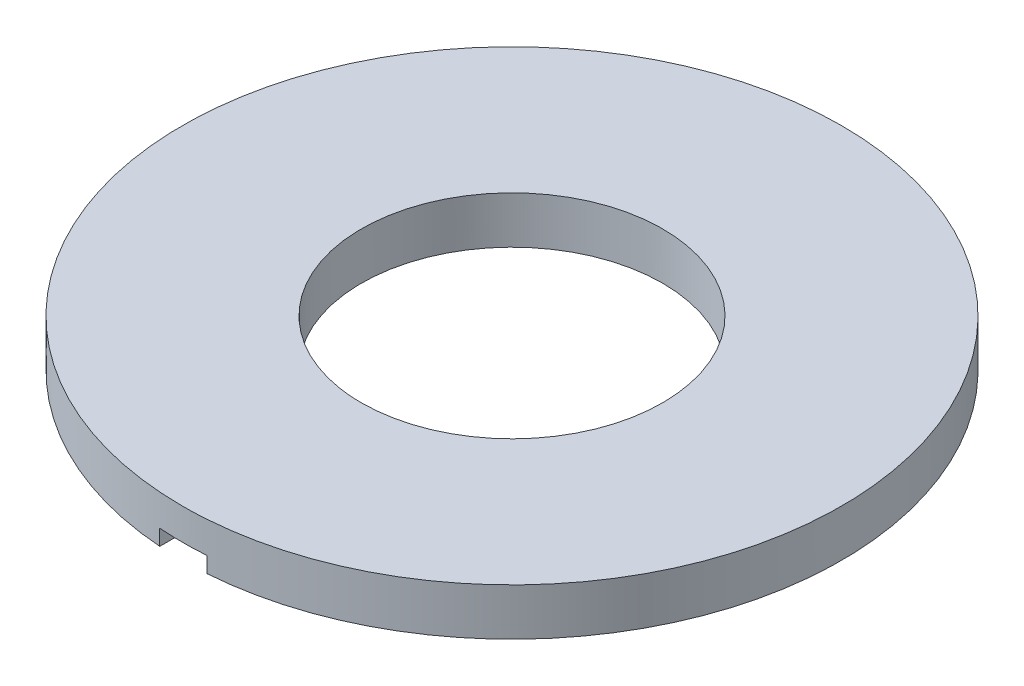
ISO-10303-21;
HEADER;
FILE_DESCRIPTION(('STEP AP214'),'2;1');
FILE_NAME('part.step','',(''),(''),'','','');
FILE_SCHEMA(('AUTOMOTIVE_DESIGN { 1 0 10303 214 1 1 1 1 }'));
ENDSEC;
DATA;
#1=APPLICATION_CONTEXT('core data for automotive mechanical design processes');
#2=APPLICATION_PROTOCOL_DEFINITION('international standard','automotive_design',2000,#1);
#3=PRODUCT_CONTEXT('',#1,'mechanical');
#4=PRODUCT('Part','Part','',(#3));
#5=PRODUCT_RELATED_PRODUCT_CATEGORY('part','',(#4));
#6=PRODUCT_DEFINITION_FORMATION('','',#4);
#7=PRODUCT_DEFINITION_CONTEXT('part definition',#1,'design');
#8=PRODUCT_DEFINITION('design','',#6,#7);
#9=PRODUCT_DEFINITION_SHAPE('','',#8);
#10=(LENGTH_UNIT() NAMED_UNIT(*) SI_UNIT(.MILLI.,.METRE.));
#11=(NAMED_UNIT(*) PLANE_ANGLE_UNIT() SI_UNIT($,.RADIAN.));
#12=(NAMED_UNIT(*) SI_UNIT($,.STERADIAN.) SOLID_ANGLE_UNIT());
#13=UNCERTAINTY_MEASURE_WITH_UNIT(LENGTH_MEASURE(1.E-05),#10,'distance_accuracy_value','');
#14=(GEOMETRIC_REPRESENTATION_CONTEXT(3) GLOBAL_UNCERTAINTY_ASSIGNED_CONTEXT((#13)) GLOBAL_UNIT_ASSIGNED_CONTEXT((#10,
#11,#12)) REPRESENTATION_CONTEXT('',''));
#15=CARTESIAN_POINT('',(0.,0.,0.));
#16=DIRECTION('',(0.,0.,1.));
#17=DIRECTION('',(1.,0.,0.));
#18=AXIS2_PLACEMENT_3D('',#15,#16,#17);
#19=CARTESIAN_POINT('',(0.,0.5,0.));
#20=DIRECTION('',(0.,1.,0.));
#21=DIRECTION('',(0.,0.,1.));
#22=AXIS2_PLACEMENT_3D('',#19,#20,#21);
#23=PLANE('',#22);
#24=CARTESIAN_POINT('',(0.,0.5,0.));
#25=DIRECTION('',(0.,1.,0.));
#26=DIRECTION('',(0.,0.,1.));
#27=AXIS2_PLACEMENT_3D('',#24,#25,#26);
#28=CIRCLE('',#27,3.5);
#29=CARTESIAN_POINT('',(0.,0.5,3.5));
#30=VERTEX_POINT('',#29);
#31=EDGE_CURVE('E113',#30,#30,#28,.T.);
#32=ORIENTED_EDGE('',*,*,#31,.T.);
#33=EDGE_LOOP('',(#32));
#34=FACE_BOUND('',#33,.T.);
#35=CARTESIAN_POINT('',(0.,0.5,0.));
#36=DIRECTION('',(0.,1.,0.));
#37=DIRECTION('',(0.,0.,1.));
#38=AXIS2_PLACEMENT_3D('',#35,#36,#37);
#39=CIRCLE('',#38,1.6);
#40=CARTESIAN_POINT('',(0.,0.5,1.6));
#41=VERTEX_POINT('',#40);
#42=EDGE_CURVE('E102',#41,#41,#39,.T.);
#43=ORIENTED_EDGE('',*,*,#42,.F.);
#44=EDGE_LOOP('',(#43));
#45=FACE_BOUND('',#44,.T.);
#46=ADVANCED_FACE('F39',(#34,#45),#23,.T.);
#47=CARTESIAN_POINT('',(0.,0.,0.));
#48=DIRECTION('',(0.,1.,0.));
#49=DIRECTION('',(0.,0.,1.));
#50=AXIS2_PLACEMENT_3D('',#47,#48,#49);
#51=PLANE('',#50);
#52=CARTESIAN_POINT('',(0.,0.,0.));
#53=DIRECTION('',(0.,1.,0.));
#54=DIRECTION('',(0.,0.,1.));
#55=AXIS2_PLACEMENT_3D('',#52,#53,#54);
#56=CIRCLE('',#55,3.5);
#57=CARTESIAN_POINT('',(0.25,0.,3.49106001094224));
#58=VERTEX_POINT('',#57);
#59=CARTESIAN_POINT('',(-0.25,0.,3.49106001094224));
#60=VERTEX_POINT('',#59);
#61=EDGE_CURVE('E94',#58,#60,#56,.T.);
#62=ORIENTED_EDGE('',*,*,#61,.F.);
#63=DIRECTION('',(0.,0.,1.));
#64=VECTOR('',#63,1.);
#65=CARTESIAN_POINT('',(0.25,0.,-0.3));
#66=LINE('',#65,#64);
#67=CARTESIAN_POINT('',(0.25,0.,1.58034806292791));
#68=VERTEX_POINT('',#67);
#69=EDGE_CURVE('E81',#68,#58,#66,.T.);
#70=ORIENTED_EDGE('',*,*,#69,.F.);
#71=CARTESIAN_POINT('',(0.,0.,0.));
#72=DIRECTION('',(0.,1.,0.));
#73=DIRECTION('',(0.,0.,1.));
#74=AXIS2_PLACEMENT_3D('',#71,#72,#73);
#75=CIRCLE('',#74,1.6);
#76=CARTESIAN_POINT('',(-0.25,0.,1.58034806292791));
#77=VERTEX_POINT('',#76);
#78=EDGE_CURVE('E92',#68,#77,#75,.T.);
#79=ORIENTED_EDGE('',*,*,#78,.T.);
#80=DIRECTION('',(0.,0.,-1.));
#81=VECTOR('',#80,1.);
#82=CARTESIAN_POINT('',(-0.25,0.,-0.3));
#83=LINE('',#82,#81);
#84=EDGE_CURVE('E96',#60,#77,#83,.T.);
#85=ORIENTED_EDGE('',*,*,#84,.F.);
#86=EDGE_LOOP('',(#62,#70,#79,#85));
#87=FACE_BOUND('',#86,.T.);
#88=ADVANCED_FACE('F90',(#87),#51,.F.);
#89=CARTESIAN_POINT('',(0.,0.5,0.));
#90=DIRECTION('',(0.,-1.,0.));
#91=DIRECTION('',(0.,0.,-1.));
#92=AXIS2_PLACEMENT_3D('',#89,#90,#91);
#93=CYLINDRICAL_SURFACE('',#92,3.5);
#94=ORIENTED_EDGE('',*,*,#31,.F.);
#95=EDGE_LOOP('',(#94));
#96=FACE_BOUND('',#95,.T.);
#97=CARTESIAN_POINT('',(0.,0.166666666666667,0.));
#98=DIRECTION('',(0.,1.,0.));
#99=DIRECTION('',(0.,0.,1.));
#100=AXIS2_PLACEMENT_3D('',#97,#98,#99);
#101=CIRCLE('',#100,3.5);
#102=CARTESIAN_POINT('',(-0.25,0.166666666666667,3.49106001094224));
#103=VERTEX_POINT('',#102);
#104=CARTESIAN_POINT('',(0.25,0.166666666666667,3.49106001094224));
#105=VERTEX_POINT('',#104);
#106=EDGE_CURVE('E60',#103,#105,#101,.T.);
#107=ORIENTED_EDGE('',*,*,#106,.T.);
#108=DIRECTION('',(0.,-1.,0.));
#109=VECTOR('',#108,1.);
#110=CARTESIAN_POINT('',(0.25,0.5,3.49106001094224));
#111=LINE('',#110,#109);
#112=EDGE_CURVE('E103',#105,#58,#111,.T.);
#113=ORIENTED_EDGE('',*,*,#112,.T.);
#114=ORIENTED_EDGE('',*,*,#61,.T.);
#115=DIRECTION('',(0.,-1.,0.));
#116=VECTOR('',#115,1.);
#117=CARTESIAN_POINT('',(-0.25,0.5,3.49106001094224));
#118=LINE('',#117,#116);
#119=EDGE_CURVE('E110',#60,#103,#118,.F.);
#120=ORIENTED_EDGE('',*,*,#119,.T.);
#121=EDGE_LOOP('',(#107,#113,#114,#120));
#122=FACE_BOUND('',#121,.T.);
#123=ADVANCED_FACE('F41',(#96,#122),#93,.T.);
#124=CARTESIAN_POINT('',(0.,0.5,0.));
#125=DIRECTION('',(0.,-1.,0.));
#126=DIRECTION('',(0.,0.,-1.));
#127=AXIS2_PLACEMENT_3D('',#124,#125,#126);
#128=CYLINDRICAL_SURFACE('',#127,1.6);
#129=DIRECTION('',(0.,-1.,0.));
#130=VECTOR('',#129,1.);
#131=CARTESIAN_POINT('',(0.25,0.5,1.58034806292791));
#132=LINE('',#131,#130);
#133=CARTESIAN_POINT('',(0.25,0.166666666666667,1.58034806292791));
#134=VERTEX_POINT('',#133);
#135=EDGE_CURVE('E11',#134,#68,#132,.T.);
#136=ORIENTED_EDGE('',*,*,#135,.F.);
#137=CARTESIAN_POINT('',(0.,0.166666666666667,0.));
#138=DIRECTION('',(0.,1.,0.));
#139=DIRECTION('',(0.,0.,1.));
#140=AXIS2_PLACEMENT_3D('',#137,#138,#139);
#141=CIRCLE('',#140,1.6);
#142=CARTESIAN_POINT('',(-0.25,0.166666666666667,1.58034806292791));
#143=VERTEX_POINT('',#142);
#144=EDGE_CURVE('E117',#143,#134,#141,.T.);
#145=ORIENTED_EDGE('',*,*,#144,.F.);
#146=DIRECTION('',(0.,-1.,0.));
#147=VECTOR('',#146,1.);
#148=CARTESIAN_POINT('',(-0.25,0.5,1.58034806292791));
#149=LINE('',#148,#147);
#150=EDGE_CURVE('E48',#77,#143,#149,.F.);
#151=ORIENTED_EDGE('',*,*,#150,.F.);
#152=ORIENTED_EDGE('',*,*,#78,.F.);
#153=EDGE_LOOP('',(#136,#145,#151,#152));
#154=FACE_BOUND('',#153,.T.);
#155=ORIENTED_EDGE('',*,*,#42,.T.);
#156=EDGE_LOOP('',(#155));
#157=FACE_BOUND('',#156,.T.);
#158=ADVANCED_FACE('F99',(#154,#157),#128,.F.);
#159=CARTESIAN_POINT('',(0.25,0.166666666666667,-0.3));
#160=DIRECTION('',(1.,0.,0.));
#161=DIRECTION('',(0.,0.,-1.));
#162=AXIS2_PLACEMENT_3D('',#159,#160,#161);
#163=PLANE('',#162);
#164=DIRECTION('',(0.,0.,1.));
#165=VECTOR('',#164,1.);
#166=CARTESIAN_POINT('',(0.25,0.166666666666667,-0.3));
#167=LINE('',#166,#165);
#168=EDGE_CURVE('E83',#134,#105,#167,.T.);
#169=ORIENTED_EDGE('',*,*,#168,.F.);
#170=ORIENTED_EDGE('',*,*,#135,.T.);
#171=ORIENTED_EDGE('',*,*,#69,.T.);
#172=ORIENTED_EDGE('',*,*,#112,.F.);
#173=EDGE_LOOP('',(#169,#170,#171,#172));
#174=FACE_BOUND('',#173,.T.);
#175=ADVANCED_FACE('F79',(#174),#163,.F.);
#176=CARTESIAN_POINT('',(-0.25,0.166666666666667,-0.3));
#177=DIRECTION('',(-1.,0.,0.));
#178=DIRECTION('',(0.,0.,1.));
#179=AXIS2_PLACEMENT_3D('',#176,#177,#178);
#180=PLANE('',#179);
#181=ORIENTED_EDGE('',*,*,#84,.T.);
#182=ORIENTED_EDGE('',*,*,#150,.T.);
#183=DIRECTION('',(0.,0.,-1.));
#184=VECTOR('',#183,1.);
#185=CARTESIAN_POINT('',(-0.25,0.166666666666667,-0.3));
#186=LINE('',#185,#184);
#187=EDGE_CURVE('E55',#103,#143,#186,.T.);
#188=ORIENTED_EDGE('',*,*,#187,.F.);
#189=ORIENTED_EDGE('',*,*,#119,.F.);
#190=EDGE_LOOP('',(#181,#182,#188,#189));
#191=FACE_BOUND('',#190,.T.);
#192=ADVANCED_FACE('F123',(#191),#180,.F.);
#193=CARTESIAN_POINT('',(0.,0.166666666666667,0.));
#194=DIRECTION('',(0.,1.,0.));
#195=DIRECTION('',(0.,0.,1.));
#196=AXIS2_PLACEMENT_3D('',#193,#194,#195);
#197=PLANE('',#196);
#198=ORIENTED_EDGE('',*,*,#106,.F.);
#199=ORIENTED_EDGE('',*,*,#187,.T.);
#200=ORIENTED_EDGE('',*,*,#144,.T.);
#201=ORIENTED_EDGE('',*,*,#168,.T.);
#202=EDGE_LOOP('',(#198,#199,#200,#201));
#203=FACE_BOUND('',#202,.T.);
#204=ADVANCED_FACE('F125',(#203),#197,.F.);
#205=CLOSED_SHELL('',(#46,#88,#123,#158,#175,#192,#204));
#206=MANIFOLD_SOLID_BREP('B2',#205);
#207=ADVANCED_BREP_SHAPE_REPRESENTATION('',(#18,#206),#14);
#208=SHAPE_DEFINITION_REPRESENTATION(#9,#207);
ENDSEC;
END-ISO-10303-21;
